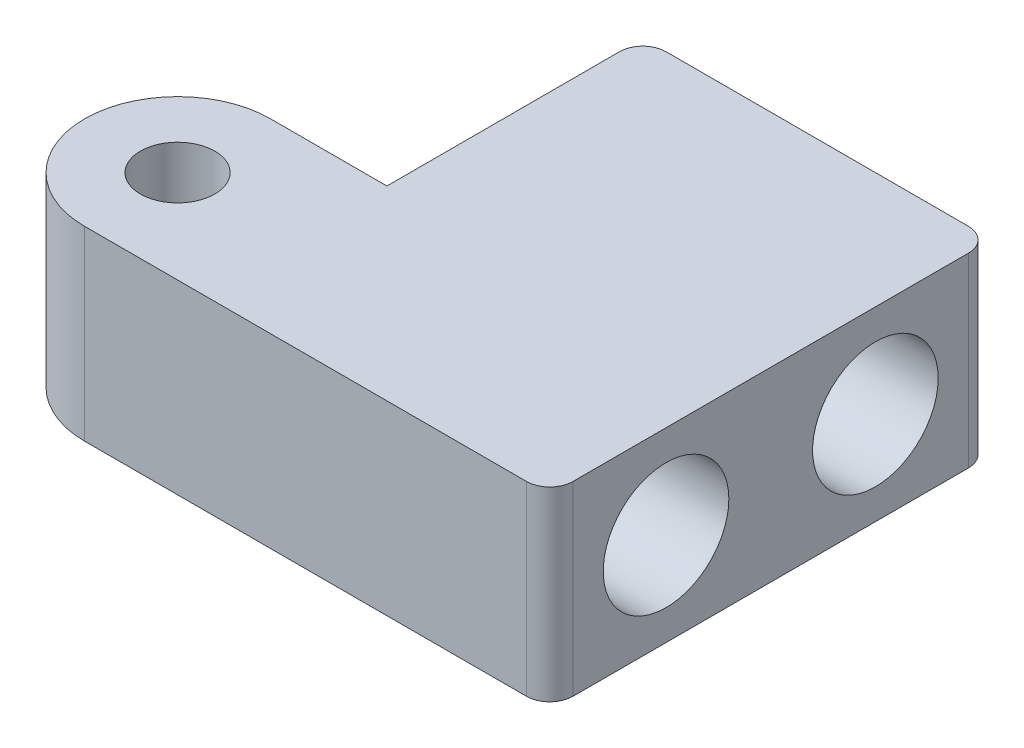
from build123d import *

# Parameters (mm, degrees)
SKETCH_1_R          = 1.6
EXTRUDE_1_DEPTH     = 8
SKETCH_2_R          = 2.7
CUT_EXTRUDE_1_DEPTH = 10
FILLET_1_R          = 1


with BuildPart() as part:
    # Sketch 1 → Extrude 1 (new body)
    with BuildSketch(Plane(origin=(0, 0, 0), x_dir=(1, 0, 0), z_dir=(0, 1, 0))):
        with BuildLine():
            ThreePointArc((0, 4), (-4, 0), (0, -4))
            Line((0, -4), (20, -4))
            Line((20, -4), (20, 15))
            Line((20, 15), (5, 15))
            Line((5, 15), (5, 4))
            Line((5, 4), (0, 4))
        make_face()
        with Locations(Location((0, 0, 0), (0, 0, 270))):
            Circle(SKETCH_1_R, mode=Mode.SUBTRACT)
    extrude(amount=EXTRUDE_1_DEPTH)

    # Sketch 2 → Cut-Extrude 1 (cut)
    with BuildSketch(Plane(origin=(20, 0, 0), x_dir=(0, 0, -1), z_dir=(1, 0, 0))):
        with Locations((10, 4)):
            Circle(SKETCH_2_R)
        with Locations((1, 4)):
            Circle(SKETCH_2_R)
    extrude(amount=-CUT_EXTRUDE_1_DEPTH, mode=Mode.SUBTRACT)

    # Fillet 1
    fillet_1_edges = [part.edges().sort_by_distance(p)[0] for p in [
        (20, 4, 4),
        (5, 4, -15),
        (20, 4, -15),
    ]]
    fillet(fillet_1_edges, radius=FILLET_1_R)


solid = part.part
